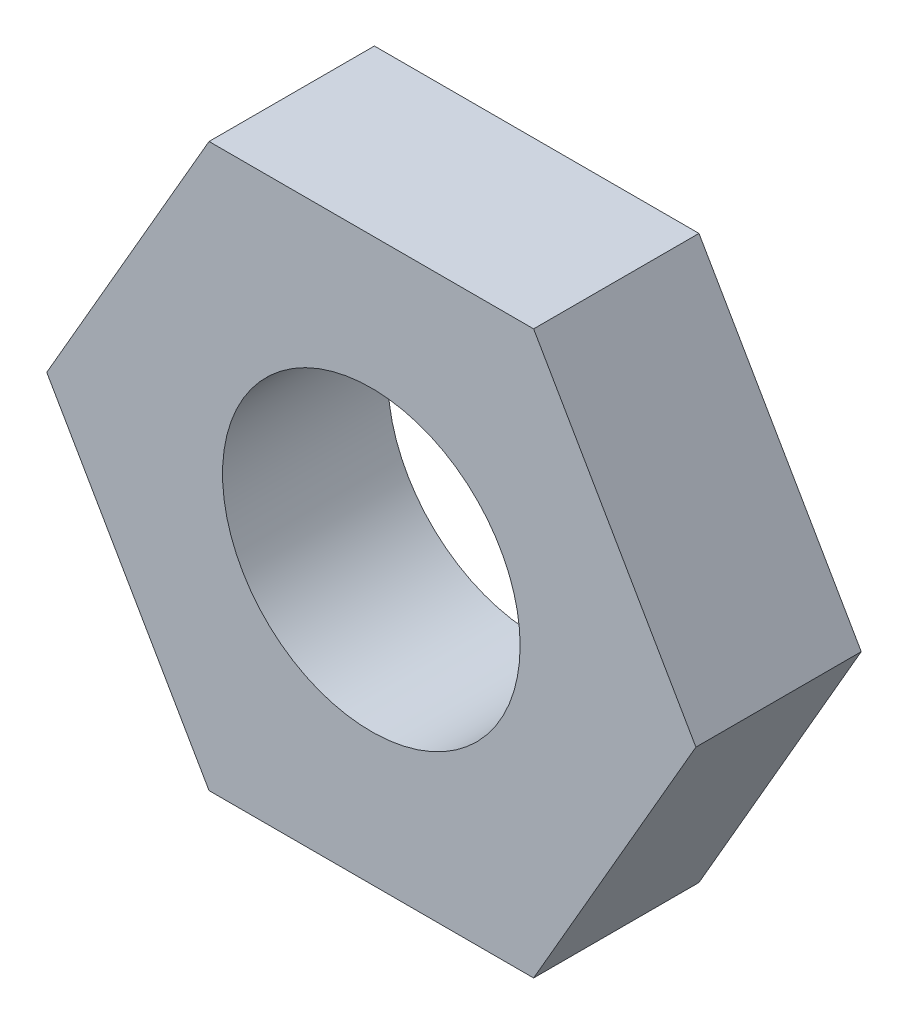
ISO-10303-21;
HEADER;
FILE_DESCRIPTION(('STEP AP214'),'2;1');
FILE_NAME('part.step','',(''),(''),'','','');
FILE_SCHEMA(('AUTOMOTIVE_DESIGN { 1 0 10303 214 1 1 1 1 }'));
ENDSEC;
DATA;
#1=APPLICATION_CONTEXT('core data for automotive mechanical design processes');
#2=APPLICATION_PROTOCOL_DEFINITION('international standard','automotive_design',2000,#1);
#3=PRODUCT_CONTEXT('',#1,'mechanical');
#4=PRODUCT('Part','Part','',(#3));
#5=PRODUCT_RELATED_PRODUCT_CATEGORY('part','',(#4));
#6=PRODUCT_DEFINITION_FORMATION('','',#4);
#7=PRODUCT_DEFINITION_CONTEXT('part definition',#1,'design');
#8=PRODUCT_DEFINITION('design','',#6,#7);
#9=PRODUCT_DEFINITION_SHAPE('','',#8);
#10=(LENGTH_UNIT() NAMED_UNIT(*) SI_UNIT(.MILLI.,.METRE.));
#11=(NAMED_UNIT(*) PLANE_ANGLE_UNIT() SI_UNIT($,.RADIAN.));
#12=(NAMED_UNIT(*) SI_UNIT($,.STERADIAN.) SOLID_ANGLE_UNIT());
#13=UNCERTAINTY_MEASURE_WITH_UNIT(LENGTH_MEASURE(1.E-05),#10,'distance_accuracy_value','');
#14=(GEOMETRIC_REPRESENTATION_CONTEXT(3) GLOBAL_UNCERTAINTY_ASSIGNED_CONTEXT((#13)) GLOBAL_UNIT_ASSIGNED_CONTEXT((#10,
#11,#12)) REPRESENTATION_CONTEXT('',''));
#15=CARTESIAN_POINT('',(0.,0.,0.));
#16=DIRECTION('',(0.,0.,1.));
#17=DIRECTION('',(1.,0.,0.));
#18=AXIS2_PLACEMENT_3D('',#15,#16,#17);
#19=CARTESIAN_POINT('',(9.81495457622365,0.,0.));
#20=DIRECTION('',(0.,0.,-1.));
#21=DIRECTION('',(-1.,0.,0.));
#22=AXIS2_PLACEMENT_3D('',#19,#20,#21);
#23=PLANE('',#22);
#24=DIRECTION('',(-0.5,0.866025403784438,0.));
#25=VECTOR('',#24,1.);
#26=CARTESIAN_POINT('',(9.81495457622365,0.,0.));
#27=LINE('',#26,#25);
#28=CARTESIAN_POINT('',(9.81495457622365,0.,0.));
#29=VERTEX_POINT('',#28);
#30=CARTESIAN_POINT('',(4.90747728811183,8.5,0.));
#31=VERTEX_POINT('',#30);
#32=EDGE_CURVE('E87',#29,#31,#27,.T.);
#33=ORIENTED_EDGE('',*,*,#32,.F.);
#34=DIRECTION('',(0.500000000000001,0.866025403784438,0.));
#35=VECTOR('',#34,1.);
#36=CARTESIAN_POINT('',(4.90747728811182,-8.5,0.));
#37=LINE('',#36,#35);
#38=CARTESIAN_POINT('',(4.90747728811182,-8.5,0.));
#39=VERTEX_POINT('',#38);
#40=EDGE_CURVE('E113',#39,#29,#37,.T.);
#41=ORIENTED_EDGE('',*,*,#40,.F.);
#42=DIRECTION('',(1.,0.,0.));
#43=VECTOR('',#42,1.);
#44=CARTESIAN_POINT('',(-4.90747728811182,-8.5,0.));
#45=LINE('',#44,#43);
#46=CARTESIAN_POINT('',(-4.90747728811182,-8.5,0.));
#47=VERTEX_POINT('',#46);
#48=EDGE_CURVE('E111',#47,#39,#45,.T.);
#49=ORIENTED_EDGE('',*,*,#48,.F.);
#50=DIRECTION('',(0.5,-0.866025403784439,0.));
#51=VECTOR('',#50,1.);
#52=CARTESIAN_POINT('',(-9.81495457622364,0.,0.));
#53=LINE('',#52,#51);
#54=CARTESIAN_POINT('',(-9.81495457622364,0.,0.));
#55=VERTEX_POINT('',#54);
#56=EDGE_CURVE('E109',#55,#47,#53,.T.);
#57=ORIENTED_EDGE('',*,*,#56,.F.);
#58=DIRECTION('',(-0.5,-0.866025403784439,0.));
#59=VECTOR('',#58,1.);
#60=CARTESIAN_POINT('',(-4.90747728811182,8.5,0.));
#61=LINE('',#60,#59);
#62=CARTESIAN_POINT('',(-4.90747728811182,8.5,0.));
#63=VERTEX_POINT('',#62);
#64=EDGE_CURVE('E89',#63,#55,#61,.T.);
#65=ORIENTED_EDGE('',*,*,#64,.F.);
#66=DIRECTION('',(-1.,0.,0.));
#67=VECTOR('',#66,1.);
#68=CARTESIAN_POINT('',(4.90747728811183,8.5,0.));
#69=LINE('',#68,#67);
#70=EDGE_CURVE('E83',#31,#63,#69,.T.);
#71=ORIENTED_EDGE('',*,*,#70,.F.);
#72=EDGE_LOOP('',(#33,#41,#49,#57,#65,#71));
#73=FACE_BOUND('',#72,.T.);
#74=CARTESIAN_POINT('',(0.,0.,0.));
#75=DIRECTION('',(0.,0.,1.));
#76=DIRECTION('',(1.,0.,0.));
#77=AXIS2_PLACEMENT_3D('',#74,#75,#76);
#78=CIRCLE('',#77,4.5);
#79=CARTESIAN_POINT('',(4.5,0.,0.));
#80=VERTEX_POINT('',#79);
#81=EDGE_CURVE('E104',#80,#80,#78,.T.);
#82=ORIENTED_EDGE('',*,*,#81,.T.);
#83=EDGE_LOOP('',(#82));
#84=FACE_BOUND('',#83,.T.);
#85=ADVANCED_FACE('F30',(#73,#84),#23,.T.);
#86=CARTESIAN_POINT('',(9.81495457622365,0.,5.));
#87=DIRECTION('',(-0.866025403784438,-0.5,0.));
#88=DIRECTION('',(0.5,-0.866025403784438,0.));
#89=AXIS2_PLACEMENT_3D('',#86,#87,#88);
#90=PLANE('',#89);
#91=ORIENTED_EDGE('',*,*,#32,.T.);
#92=DIRECTION('',(0.,0.,-1.));
#93=VECTOR('',#92,1.);
#94=CARTESIAN_POINT('',(4.90747728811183,8.5,5.));
#95=LINE('',#94,#93);
#96=CARTESIAN_POINT('',(4.90747728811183,8.5,5.));
#97=VERTEX_POINT('',#96);
#98=EDGE_CURVE('E11',#97,#31,#95,.T.);
#99=ORIENTED_EDGE('',*,*,#98,.F.);
#100=DIRECTION('',(-0.5,0.866025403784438,0.));
#101=VECTOR('',#100,1.);
#102=CARTESIAN_POINT('',(9.81495457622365,0.,5.));
#103=LINE('',#102,#101);
#104=CARTESIAN_POINT('',(9.81495457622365,0.,5.));
#105=VERTEX_POINT('',#104);
#106=EDGE_CURVE('E115',#105,#97,#103,.T.);
#107=ORIENTED_EDGE('',*,*,#106,.F.);
#108=DIRECTION('',(0.,0.,-1.));
#109=VECTOR('',#108,1.);
#110=CARTESIAN_POINT('',(9.81495457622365,0.,5.));
#111=LINE('',#110,#109);
#112=EDGE_CURVE('E100',#105,#29,#111,.T.);
#113=ORIENTED_EDGE('',*,*,#112,.T.);
#114=EDGE_LOOP('',(#91,#99,#107,#113));
#115=FACE_BOUND('',#114,.T.);
#116=ADVANCED_FACE('F32',(#115),#90,.F.);
#117=CARTESIAN_POINT('',(4.90747728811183,8.5,5.));
#118=DIRECTION('',(0.,-1.,0.));
#119=DIRECTION('',(0.,0.,-1.));
#120=AXIS2_PLACEMENT_3D('',#117,#118,#119);
#121=PLANE('',#120);
#122=ORIENTED_EDGE('',*,*,#70,.T.);
#123=DIRECTION('',(0.,0.,-1.));
#124=VECTOR('',#123,1.);
#125=CARTESIAN_POINT('',(-4.90747728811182,8.5,5.));
#126=LINE('',#125,#124);
#127=CARTESIAN_POINT('',(-4.90747728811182,8.5,5.));
#128=VERTEX_POINT('',#127);
#129=EDGE_CURVE('E38',#128,#63,#126,.T.);
#130=ORIENTED_EDGE('',*,*,#129,.F.);
#131=DIRECTION('',(-1.,0.,0.));
#132=VECTOR('',#131,1.);
#133=CARTESIAN_POINT('',(4.90747728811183,8.5,5.));
#134=LINE('',#133,#132);
#135=EDGE_CURVE('E96',#97,#128,#134,.T.);
#136=ORIENTED_EDGE('',*,*,#135,.F.);
#137=ORIENTED_EDGE('',*,*,#98,.T.);
#138=EDGE_LOOP('',(#122,#130,#136,#137));
#139=FACE_BOUND('',#138,.T.);
#140=ADVANCED_FACE('F95',(#139),#121,.F.);
#141=CARTESIAN_POINT('',(-4.90747728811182,8.5,5.));
#142=DIRECTION('',(0.866025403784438,-0.5,0.));
#143=DIRECTION('',(0.5,0.866025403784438,0.));
#144=AXIS2_PLACEMENT_3D('',#141,#142,#143);
#145=PLANE('',#144);
#146=ORIENTED_EDGE('',*,*,#64,.T.);
#147=DIRECTION('',(0.,0.,-1.));
#148=VECTOR('',#147,1.);
#149=CARTESIAN_POINT('',(-9.81495457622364,0.,5.));
#150=LINE('',#149,#148);
#151=CARTESIAN_POINT('',(-9.81495457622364,0.,5.));
#152=VERTEX_POINT('',#151);
#153=EDGE_CURVE('E131',#152,#55,#150,.T.);
#154=ORIENTED_EDGE('',*,*,#153,.F.);
#155=DIRECTION('',(-0.5,-0.866025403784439,0.));
#156=VECTOR('',#155,1.);
#157=CARTESIAN_POINT('',(-4.90747728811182,8.5,5.));
#158=LINE('',#157,#156);
#159=EDGE_CURVE('E118',#128,#152,#158,.T.);
#160=ORIENTED_EDGE('',*,*,#159,.F.);
#161=ORIENTED_EDGE('',*,*,#129,.T.);
#162=EDGE_LOOP('',(#146,#154,#160,#161));
#163=FACE_BOUND('',#162,.T.);
#164=ADVANCED_FACE('F135',(#163),#145,.F.);
#165=CARTESIAN_POINT('',(-9.81495457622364,0.,5.));
#166=DIRECTION('',(0.866025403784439,0.5,0.));
#167=DIRECTION('',(-0.5,0.866025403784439,0.));
#168=AXIS2_PLACEMENT_3D('',#165,#166,#167);
#169=PLANE('',#168);
#170=ORIENTED_EDGE('',*,*,#56,.T.);
#171=DIRECTION('',(0.,0.,-1.));
#172=VECTOR('',#171,1.);
#173=CARTESIAN_POINT('',(-4.90747728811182,-8.5,5.));
#174=LINE('',#173,#172);
#175=CARTESIAN_POINT('',(-4.90747728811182,-8.5,5.));
#176=VERTEX_POINT('',#175);
#177=EDGE_CURVE('E128',#176,#47,#174,.T.);
#178=ORIENTED_EDGE('',*,*,#177,.F.);
#179=DIRECTION('',(0.5,-0.866025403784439,0.));
#180=VECTOR('',#179,1.);
#181=CARTESIAN_POINT('',(-9.81495457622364,0.,5.));
#182=LINE('',#181,#180);
#183=EDGE_CURVE('E120',#152,#176,#182,.T.);
#184=ORIENTED_EDGE('',*,*,#183,.F.);
#185=ORIENTED_EDGE('',*,*,#153,.T.);
#186=EDGE_LOOP('',(#170,#178,#184,#185));
#187=FACE_BOUND('',#186,.T.);
#188=ADVANCED_FACE('F141',(#187),#169,.F.);
#189=CARTESIAN_POINT('',(-4.90747728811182,-8.5,5.));
#190=DIRECTION('',(0.,1.,0.));
#191=DIRECTION('',(0.,0.,1.));
#192=AXIS2_PLACEMENT_3D('',#189,#190,#191);
#193=PLANE('',#192);
#194=ORIENTED_EDGE('',*,*,#48,.T.);
#195=DIRECTION('',(0.,0.,-1.));
#196=VECTOR('',#195,1.);
#197=CARTESIAN_POINT('',(4.90747728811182,-8.5,5.));
#198=LINE('',#197,#196);
#199=CARTESIAN_POINT('',(4.90747728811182,-8.5,5.));
#200=VERTEX_POINT('',#199);
#201=EDGE_CURVE('E125',#200,#39,#198,.T.);
#202=ORIENTED_EDGE('',*,*,#201,.F.);
#203=DIRECTION('',(1.,0.,0.));
#204=VECTOR('',#203,1.);
#205=CARTESIAN_POINT('',(-4.90747728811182,-8.5,5.));
#206=LINE('',#205,#204);
#207=EDGE_CURVE('E50',#176,#200,#206,.T.);
#208=ORIENTED_EDGE('',*,*,#207,.F.);
#209=ORIENTED_EDGE('',*,*,#177,.T.);
#210=EDGE_LOOP('',(#194,#202,#208,#209));
#211=FACE_BOUND('',#210,.T.);
#212=ADVANCED_FACE('F144',(#211),#193,.F.);
#213=CARTESIAN_POINT('',(4.90747728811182,-8.5,5.));
#214=DIRECTION('',(-0.866025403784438,0.500000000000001,0.));
#215=DIRECTION('',(-0.500000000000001,-0.866025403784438,0.));
#216=AXIS2_PLACEMENT_3D('',#213,#214,#215);
#217=PLANE('',#216);
#218=ORIENTED_EDGE('',*,*,#40,.T.);
#219=ORIENTED_EDGE('',*,*,#112,.F.);
#220=DIRECTION('',(0.500000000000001,0.866025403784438,0.));
#221=VECTOR('',#220,1.);
#222=CARTESIAN_POINT('',(4.90747728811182,-8.5,5.));
#223=LINE('',#222,#221);
#224=EDGE_CURVE('E45',#200,#105,#223,.T.);
#225=ORIENTED_EDGE('',*,*,#224,.F.);
#226=ORIENTED_EDGE('',*,*,#201,.T.);
#227=EDGE_LOOP('',(#218,#219,#225,#226));
#228=FACE_BOUND('',#227,.T.);
#229=ADVANCED_FACE('F146',(#228),#217,.F.);
#230=CARTESIAN_POINT('',(9.81495457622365,0.,5.));
#231=DIRECTION('',(0.,0.,-1.));
#232=DIRECTION('',(-1.,0.,0.));
#233=AXIS2_PLACEMENT_3D('',#230,#231,#232);
#234=PLANE('',#233);
#235=CARTESIAN_POINT('',(0.,0.,5.));
#236=DIRECTION('',(0.,0.,1.));
#237=DIRECTION('',(1.,0.,0.));
#238=AXIS2_PLACEMENT_3D('',#235,#236,#237);
#239=CIRCLE('',#238,4.5);
#240=CARTESIAN_POINT('',(4.5,0.,5.));
#241=VERTEX_POINT('',#240);
#242=EDGE_CURVE('E101',#241,#241,#239,.T.);
#243=ORIENTED_EDGE('',*,*,#242,.F.);
#244=EDGE_LOOP('',(#243));
#245=FACE_BOUND('',#244,.T.);
#246=ORIENTED_EDGE('',*,*,#106,.T.);
#247=ORIENTED_EDGE('',*,*,#135,.T.);
#248=ORIENTED_EDGE('',*,*,#159,.T.);
#249=ORIENTED_EDGE('',*,*,#183,.T.);
#250=ORIENTED_EDGE('',*,*,#207,.T.);
#251=ORIENTED_EDGE('',*,*,#224,.T.);
#252=EDGE_LOOP('',(#246,#247,#248,#249,#250,#251));
#253=FACE_BOUND('',#252,.T.);
#254=ADVANCED_FACE('F138',(#245,#253),#234,.F.);
#255=CARTESIAN_POINT('',(0.,0.,5.));
#256=DIRECTION('',(0.,0.,1.));
#257=DIRECTION('',(1.,0.,0.));
#258=AXIS2_PLACEMENT_3D('',#255,#256,#257);
#259=CYLINDRICAL_SURFACE('',#258,4.5);
#260=ORIENTED_EDGE('',*,*,#81,.F.);
#261=EDGE_LOOP('',(#260));
#262=FACE_BOUND('',#261,.T.);
#263=ORIENTED_EDGE('',*,*,#242,.T.);
#264=EDGE_LOOP('',(#263));
#265=FACE_BOUND('',#264,.T.);
#266=ADVANCED_FACE('F153',(#262,#265),#259,.F.);
#267=CLOSED_SHELL('',(#85,#116,#140,#164,#188,#212,#229,#254,#266));
#268=MANIFOLD_SOLID_BREP('B2',#267);
#269=ADVANCED_BREP_SHAPE_REPRESENTATION('',(#18,#268),#14);
#270=SHAPE_DEFINITION_REPRESENTATION(#9,#269);
ENDSEC;
END-ISO-10303-21;
